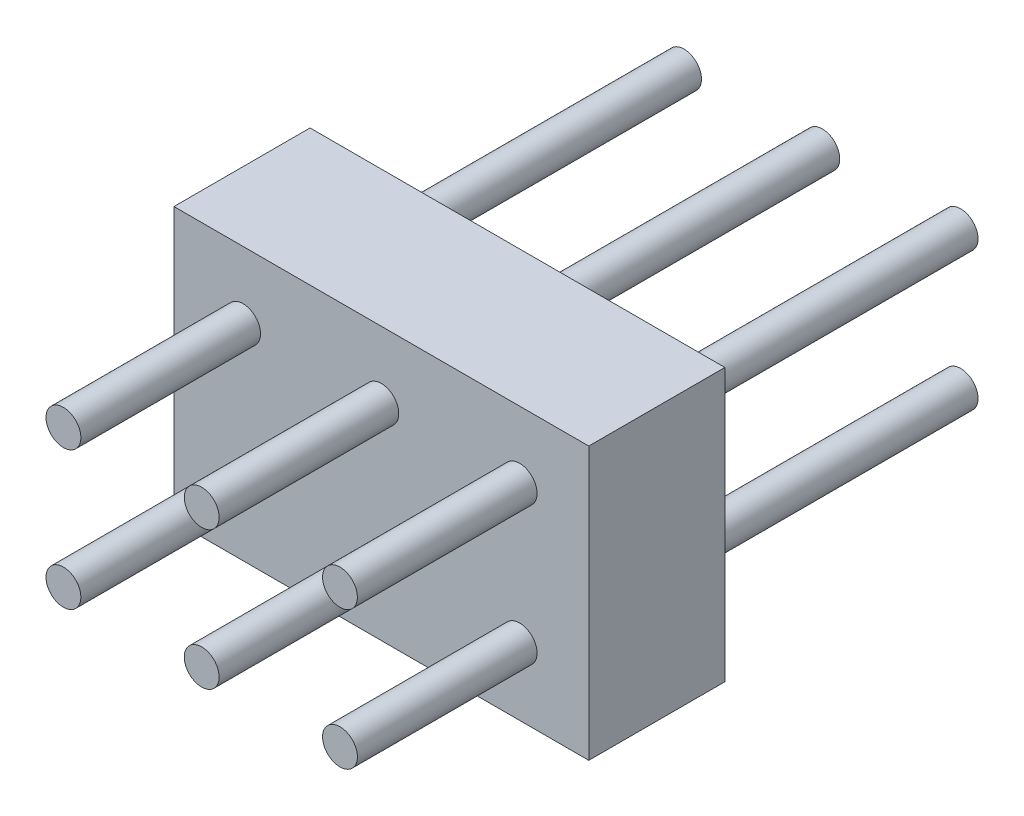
from build123d import *

# Parameters (mm, degrees)
SKETCH1_W           = 7.62
SKETCH1_H           = 5
BOSS_EXTRUDE1_DEPTH = 2.5
SKETCH2_R           = 0.32
BOSS_EXTRUDE2_DEPTH = 3.3
BOSS_EXTRUDE3_START = -8.1
SKETCH2_3_R         = 0.32
BOSS_EXTRUDE3_DEPTH = 5.6


with BuildPart() as part:
    # Sketch1 → Boss-Extrude1 (new body)
    with BuildSketch(Plane.XY):
        with Locations((3.81, 2.5)):
            Rectangle(SKETCH1_W, SKETCH1_H)
    extrude(amount=BOSS_EXTRUDE1_DEPTH)

    # Sketch2 → Boss-Extrude2 (add)
    with BuildSketch(Plane.XY.offset(2.5)):
        with Locations(Location((1.27, 1.23, 0), (0, 0, 180))):
            Circle(SKETCH2_R)
        with Locations(Location((1.27, 3.77, 0), (0, 0, 180))):
            Circle(SKETCH2_R)
        with Locations(Location((3.81, 3.77, 0), (0, 0, 180))):
            Circle(SKETCH2_R)
        with Locations(Location((3.81, 1.23, 0), (0, 0, 180))):
            Circle(SKETCH2_R)
        with Locations(Location((6.35, 3.77, 0), (0, 0, 180))):
            Circle(SKETCH2_R)
        with Locations(Location((6.35, 1.23, 0), (0, 0, 180))):
            Circle(SKETCH2_R)
    extrude(amount=BOSS_EXTRUDE2_DEPTH)

    # Sketch2_3 → Boss-Extrude3 (add)
    with BuildSketch(Plane.XY.offset(2.5).offset(BOSS_EXTRUDE3_START)):
        with Locations(Location((1.27, 1.23, 0), (0, 0, 180))):
            Circle(SKETCH2_3_R)
        with Locations(Location((1.27, 3.77, 0), (0, 0, 180))):
            Circle(SKETCH2_3_R)
        with Locations(Location((3.81, 3.77, 0), (0, 0, 180))):
            Circle(SKETCH2_3_R)
        with Locations(Location((3.81, 1.23, 0), (0, 0, 180))):
            Circle(SKETCH2_3_R)
        with Locations(Location((6.35, 3.77, 0), (0, 0, 180))):
            Circle(SKETCH2_3_R)
        with Locations(Location((6.35, 1.23, 0), (0, 0, 180))):
            Circle(SKETCH2_3_R)
    extrude(amount=BOSS_EXTRUDE3_DEPTH)


solid = part.part
